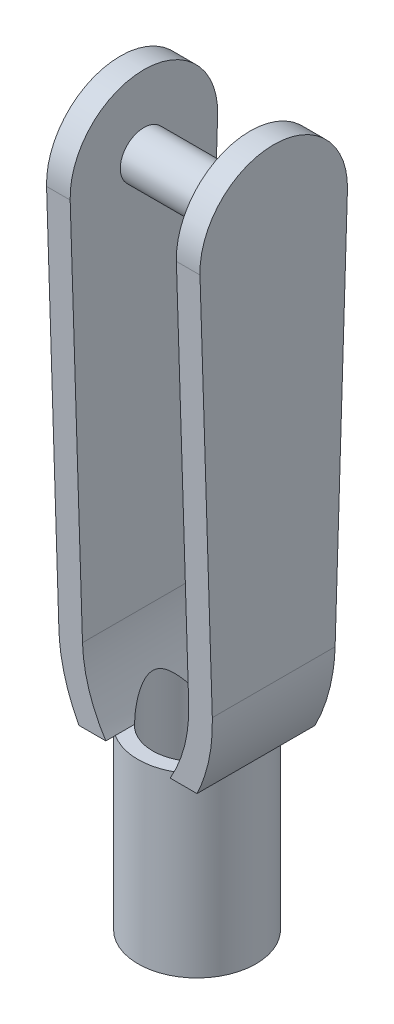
from build123d import *

# Parameters (mm, degrees)
EXTRUSION1_DEPTH        = 3
ENL_V_MAT_EXTRU_1_DEPTH = 20.527416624
ENL_V_MAT_EXTRU_2_DEPTH = 20.35458602
ESQUISSE4_R             = 0.8
EXTRUSION2_DEPTH        = 3.6
ESQUISSE5_R             = 2
EXTRUSION3_DEPTH        = 6
ESQUISSE6_R             = 1.5
ENL_V_MAT_EXTRU_3_DEPTH = 10


with BuildPart() as part:
    # Esquisse1 → Extrusion1 (new, symmetric)
    with BuildSketch(Plane.XY):
        with BuildLine():
            Line((-2.6, 2.569046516), (-2.6, 18.4))
            Line((-2.6, 18.4), (2.6, 18.4))
            Line((2.6, 18.4), (2.6, 2.569046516))
            ThreePointArc((2.6, 2.569046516), (2.448008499, 1.24995592), (2, 0))
            Line((2, 0), (-2, 0))
            ThreePointArc((-2, 0), (-2.448008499, 1.24995592), (-2.6, 2.569046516))
        make_face()
    extrude(amount=EXTRUSION1_DEPTH, both=True)

    # Esquisse2 → Enl_v. mat.-Extru.1 (cut, through all)
    with BuildSketch(Plane.XY.offset(3)):
        with BuildLine():
            Line((-1.8, 18.4), (-1.8, 2.569046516))
            ThreePointArc((-1.8, 2.569046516), (-1.619108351, 1.236306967), (-1.089522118, 0))
            Line((-1.089522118, 0), (1.089522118, 0))
            ThreePointArc((1.089522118, 0), (1.619108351, 1.236306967), (1.8, 2.569046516))
            Line((1.8, 2.569046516), (1.8, 18.4))
            Line((1.8, 18.4), (-1.8, 18.4))
        make_face()
    extrude(amount=-ENL_V_MAT_EXTRU_1_DEPTH, mode=Mode.SUBTRACT)


with BuildPart() as enl_v_mat_extru_1_piece_1:
    # of the separate pieces the step leaves, piece 1, a body of its own (enl_v_mat_extru_1_pieces)
    add(part.part.solids().sort_by_distance((-2.6, 2.569046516, -3))[0])


with BuildPart() as enl_v_mat_extru_1_piece_2:
    # of the separate pieces the step leaves, piece 2, a body of its own (enl_v_mat_extru_1_pieces)
    add(part.part.solids().sort_by_distance((1.8, 18.4, -3))[0])


with BuildPart() as enl_v_mat_extru_2_tool:
    # Esquisse3 → Enl_v. mat.-Extru.2 (new, through all)
    with BuildSketch(Plane(origin=(2.6, 0, 0), x_dir=(0, 0, -1), z_dir=(1, 0, 0))):
        with BuildLine():
            Line((-2, 0), (-2.498750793, 15.770978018))
            ThreePointArc((-2.498750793, 15.770978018), (0, 18.35), (2.498750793, 15.770978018))
            Line((2.498750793, 15.770978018), (2, 0))
            Line((2, 0), (3, 0))
            Line((3, 0), (3, 18.4))
            Line((3, 18.4), (-3, 18.4))
            Line((-3, 18.4), (-3, 0))
            Line((-3, 0), (-2, 0))
        make_face()
    extrude(amount=-ENL_V_MAT_EXTRU_2_DEPTH)


with BuildPart() as enl_v_mat_extru_1_piece_1_1:
    add(enl_v_mat_extru_1_piece_1.part)

    # Enl_v. mat.-Extru.2: cut by enl_v_mat_extru_2_tool
    add(enl_v_mat_extru_2_tool.part, mode=Mode.SUBTRACT)



with BuildPart() as enl_v_mat_extru_1_piece_2_1:
    add(enl_v_mat_extru_1_piece_2.part)

    # Enl_v. mat.-Extru.2: cut by enl_v_mat_extru_2_tool
    add(enl_v_mat_extru_2_tool.part, mode=Mode.SUBTRACT)


with BuildPart() as enl_v_mat_extru_1_piece_1_2:
    add(enl_v_mat_extru_1_piece_1_1.part)

    add(enl_v_mat_extru_1_piece_2_1.part)  # Extrusion2 merges Enl_v. mat.-Extru.1 piece 2
    # Esquisse4 → Extrusion2 (add)
    with BuildSketch(Plane(origin=(-1.8, 0, 0), x_dir=(0, 0, -1), z_dir=(1, 0, 0))):
        with Locations(Location((0, 15.85, 0), (0, 0, 270))):
            Circle(ESQUISSE4_R)
    extrude(amount=EXTRUSION2_DEPTH)

    # Esquisse5 → Extrusion3 (add)
    with BuildSketch(Plane.XZ):
        with Locations(Location((0, 0, 0), (0, 0, 56.99166325))):
            Circle(ESQUISSE5_R)
    extrude(amount=EXTRUSION3_DEPTH)

    # Esquisse6 → Enl_v. mat.-Extru.3 (cut)
    with BuildSketch(Plane.XZ.offset(6)):
        with Locations(Location((0, 0, 0), (0, 0, 270))):
            Circle(ESQUISSE6_R)
    extrude(amount=-ENL_V_MAT_EXTRU_3_DEPTH, mode=Mode.SUBTRACT)


solid = enl_v_mat_extru_1_piece_1_2.part
